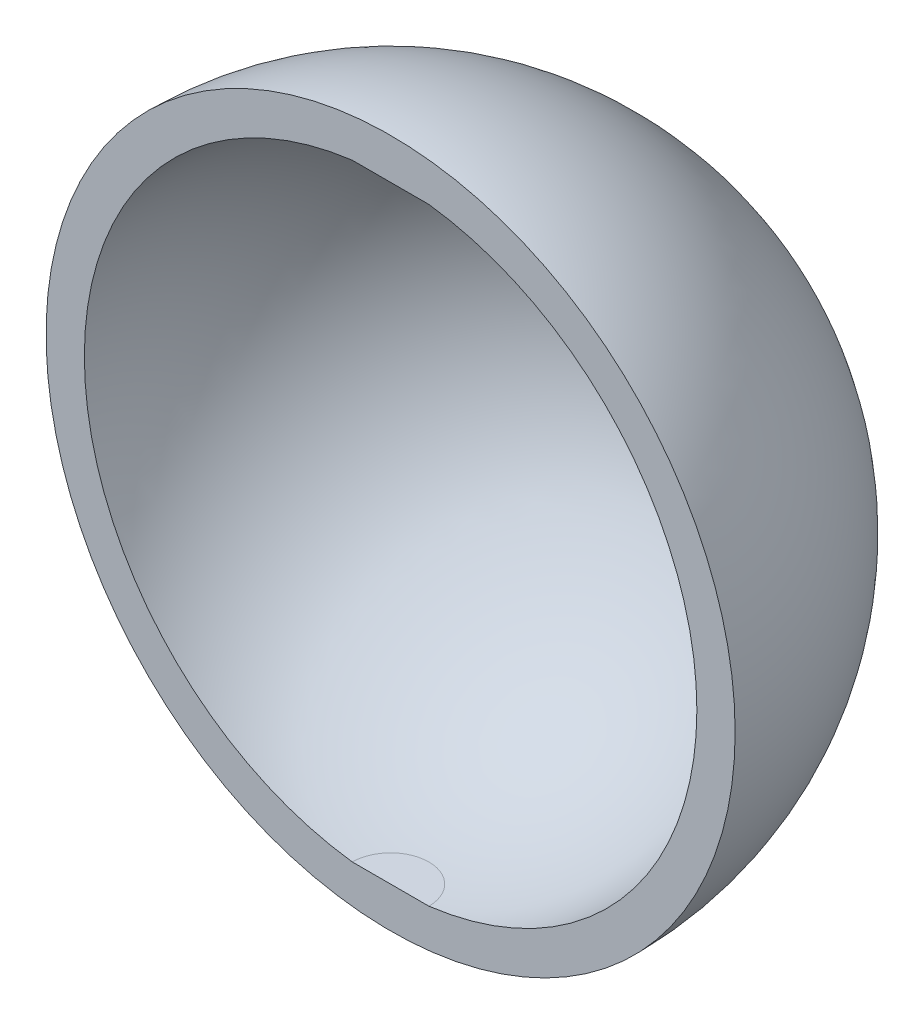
from build123d import *

# Parameters (mm, degrees)
REVOLVE1_ANGLE = 180


with BuildPart() as part:
    # Sketch1 → Revolve1 (revolve)
    with BuildSketch(Plane.XY):
        with BuildLine():
            Line((0, 0), (0, 3.374218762))
            Line((0, 3.374218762), (3.175, 3.374218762))
            ThreePointArc((3.175, 3.374218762), (25.4, 28.575), (3.175, 53.775781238))
            Line((3.175, 53.775781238), (0, 53.775781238))
            Line((0, 53.775781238), (0, 57.15))
            ThreePointArc((0, 57.15), (28.575, 28.575), (0, 0))
        make_face()
    revolve(axis=Axis((0, 0, 0), (0, 1, 0)), revolution_arc=REVOLVE1_ANGLE)


solid = part.part
